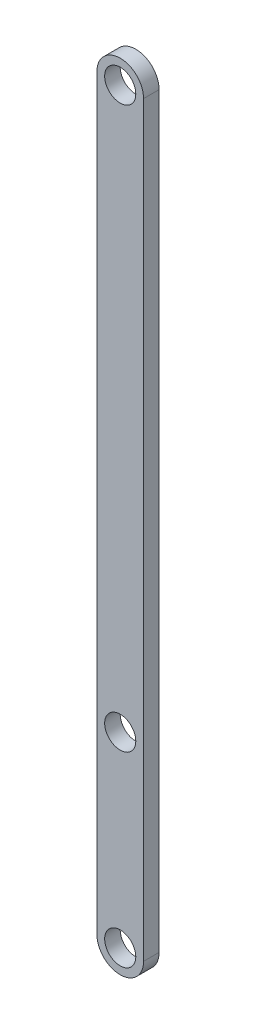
from build123d import *

# Parameters (mm, degrees)
ESQUISSE1_R      = 5
EXTRUSION1_DEPTH = 5


with BuildPart() as part:
    # Esquisse1 → Extrusion1 (new body)
    with BuildSketch(Plane.XY):
        with BuildLine():
            Line((-7.5, 240), (-7.5, 0))
            ThreePointArc((-7.5, 0), (0, -7.5), (7.5, 0))
            Line((7.5, 0), (7.5, 240))
            ThreePointArc((7.5, 240), (0, 247.5), (-7.5, 240))
        make_face()
        Circle(ESQUISSE1_R, mode=Mode.SUBTRACT)
        with Locations((0, 60)):
            Circle(ESQUISSE1_R, mode=Mode.SUBTRACT)
        with Locations((0, 240)):
            Circle(ESQUISSE1_R, mode=Mode.SUBTRACT)
    extrude(amount=EXTRUSION1_DEPTH)


solid = part.part
